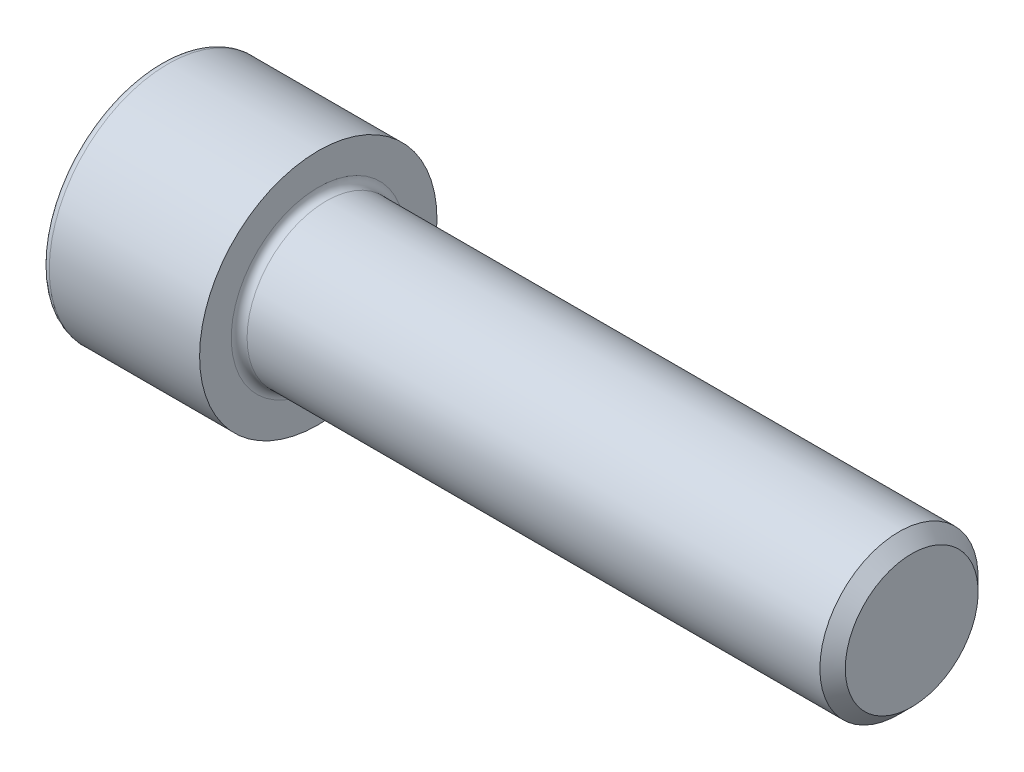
ISO-10303-21;
HEADER;
FILE_DESCRIPTION(('STEP AP214'),'2;1');
FILE_NAME('part.step','',(''),(''),'','','');
FILE_SCHEMA(('AUTOMOTIVE_DESIGN { 1 0 10303 214 1 1 1 1 }'));
ENDSEC;
DATA;
#1=APPLICATION_CONTEXT('core data for automotive mechanical design processes');
#2=APPLICATION_PROTOCOL_DEFINITION('international standard','automotive_design',2000,#1);
#3=PRODUCT_CONTEXT('',#1,'mechanical');
#4=PRODUCT('Part','Part','',(#3));
#5=PRODUCT_RELATED_PRODUCT_CATEGORY('part','',(#4));
#6=PRODUCT_DEFINITION_FORMATION('','',#4);
#7=PRODUCT_DEFINITION_CONTEXT('part definition',#1,'design');
#8=PRODUCT_DEFINITION('design','',#6,#7);
#9=PRODUCT_DEFINITION_SHAPE('','',#8);
#10=(LENGTH_UNIT() NAMED_UNIT(*) SI_UNIT(.MILLI.,.METRE.));
#11=(NAMED_UNIT(*) PLANE_ANGLE_UNIT() SI_UNIT($,.RADIAN.));
#12=(NAMED_UNIT(*) SI_UNIT($,.STERADIAN.) SOLID_ANGLE_UNIT());
#13=UNCERTAINTY_MEASURE_WITH_UNIT(LENGTH_MEASURE(1.E-05),#10,'distance_accuracy_value','');
#14=(GEOMETRIC_REPRESENTATION_CONTEXT(3) GLOBAL_UNCERTAINTY_ASSIGNED_CONTEXT((#13)) GLOBAL_UNIT_ASSIGNED_CONTEXT((#10,
#11,#12)) REPRESENTATION_CONTEXT('',''));
#15=CARTESIAN_POINT('',(0.,0.,0.));
#16=DIRECTION('',(0.,0.,1.));
#17=DIRECTION('',(1.,0.,0.));
#18=AXIS2_PLACEMENT_3D('',#15,#16,#17);
#19=CARTESIAN_POINT('',(0.,0.,0.));
#20=DIRECTION('',(-1.,0.,0.));
#21=DIRECTION('',(0.,0.,1.));
#22=AXIS2_PLACEMENT_3D('',#19,#20,#21);
#23=PLANE('',#22);
#24=DIRECTION('',(0.,-0.499999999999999,0.866025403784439));
#25=VECTOR('',#24,1.);
#26=CARTESIAN_POINT('',(-1.11022302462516E-13,5.83989797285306,0.));
#27=LINE('',#26,#25);
#28=CARTESIAN_POINT('',(-1.11022302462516E-13,5.83989797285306,0.));
#29=VERTEX_POINT('',#28);
#30=CARTESIAN_POINT('',(0.,2.91994898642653,5.05749999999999));
#31=VERTEX_POINT('',#30);
#32=EDGE_CURVE('E266',#29,#31,#27,.T.);
#33=ORIENTED_EDGE('',*,*,#32,.T.);
#34=DIRECTION('',(0.,1.,0.));
#35=VECTOR('',#34,1.);
#36=CARTESIAN_POINT('',(0.,-2.91994898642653,5.05750000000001));
#37=LINE('',#36,#35);
#38=CARTESIAN_POINT('',(0.,-2.91994898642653,5.05750000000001));
#39=VERTEX_POINT('',#38);
#40=EDGE_CURVE('E138',#39,#31,#37,.T.);
#41=ORIENTED_EDGE('',*,*,#40,.F.);
#42=DIRECTION('',(0.,-0.500000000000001,-0.866025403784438));
#43=VECTOR('',#42,1.);
#44=CARTESIAN_POINT('',(0.,-2.91994898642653,5.05750000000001));
#45=LINE('',#44,#43);
#46=CARTESIAN_POINT('',(0.,-5.83989797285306,0.));
#47=VERTEX_POINT('',#46);
#48=EDGE_CURVE('E269',#39,#47,#45,.T.);
#49=ORIENTED_EDGE('',*,*,#48,.T.);
#50=DIRECTION('',(0.,0.499999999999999,-0.866025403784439));
#51=VECTOR('',#50,1.);
#52=CARTESIAN_POINT('',(0.,-5.83989797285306,0.));
#53=LINE('',#52,#51);
#54=CARTESIAN_POINT('',(0.,-2.91994898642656,-5.05749999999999));
#55=VERTEX_POINT('',#54);
#56=EDGE_CURVE('E272',#47,#55,#53,.T.);
#57=ORIENTED_EDGE('',*,*,#56,.T.);
#58=DIRECTION('',(0.,-1.,0.));
#59=VECTOR('',#58,1.);
#60=CARTESIAN_POINT('',(0.,2.91994898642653,-5.0575));
#61=LINE('',#60,#59);
#62=CARTESIAN_POINT('',(0.,2.91994898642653,-5.0575));
#63=VERTEX_POINT('',#62);
#64=EDGE_CURVE('E275',#63,#55,#61,.T.);
#65=ORIENTED_EDGE('',*,*,#64,.F.);
#66=DIRECTION('',(0.,-0.500000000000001,-0.866025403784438));
#67=VECTOR('',#66,1.);
#68=CARTESIAN_POINT('',(-1.11022302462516E-13,5.83989797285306,0.));
#69=LINE('',#68,#67);
#70=EDGE_CURVE('E133',#29,#63,#69,.T.);
#71=ORIENTED_EDGE('',*,*,#70,.F.);
#72=EDGE_LOOP('',(#33,#41,#49,#57,#65,#71));
#73=FACE_BOUND('',#72,.T.);
#74=CARTESIAN_POINT('',(0.,0.,0.));
#75=DIRECTION('',(-1.,0.,0.));
#76=DIRECTION('',(0.,0.,1.));
#77=AXIS2_PLACEMENT_3D('',#74,#75,#76);
#78=CIRCLE('',#77,8.4);
#79=CARTESIAN_POINT('',(0.,0.,8.4));
#80=VERTEX_POINT('',#79);
#81=EDGE_CURVE('E50',#80,#80,#78,.T.);
#82=ORIENTED_EDGE('',*,*,#81,.T.);
#83=EDGE_LOOP('',(#82));
#84=FACE_BOUND('',#83,.T.);
#85=ADVANCED_FACE('F42',(#73,#84),#23,.T.);
#86=CARTESIAN_POINT('',(-31.75,0.,0.));
#87=DIRECTION('',(-1.,0.,0.));
#88=DIRECTION('',(0.,0.,1.));
#89=AXIS2_PLACEMENT_3D('',#86,#87,#88);
#90=CYLINDRICAL_SURFACE('',#89,9.);
#91=CARTESIAN_POINT('',(0.600000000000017,0.,0.));
#92=DIRECTION('',(-1.,0.,0.));
#93=DIRECTION('',(0.,0.,1.));
#94=AXIS2_PLACEMENT_3D('',#91,#92,#93);
#95=CIRCLE('',#94,9.);
#96=CARTESIAN_POINT('',(0.600000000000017,0.,9.));
#97=VERTEX_POINT('',#96);
#98=EDGE_CURVE('E13',#97,#97,#95,.F.);
#99=ORIENTED_EDGE('',*,*,#98,.T.);
#100=EDGE_LOOP('',(#99));
#101=FACE_BOUND('',#100,.T.);
#102=CARTESIAN_POINT('',(12.,0.,0.));
#103=DIRECTION('',(-1.,0.,0.));
#104=DIRECTION('',(0.,0.,1.));
#105=AXIS2_PLACEMENT_3D('',#102,#103,#104);
#106=CIRCLE('',#105,9.);
#107=CARTESIAN_POINT('',(12.,0.,9.));
#108=VERTEX_POINT('',#107);
#109=EDGE_CURVE('E156',#108,#108,#106,.T.);
#110=ORIENTED_EDGE('',*,*,#109,.T.);
#111=EDGE_LOOP('',(#110));
#112=FACE_BOUND('',#111,.T.);
#113=ADVANCED_FACE('F180',(#101,#112),#90,.T.);
#114=CARTESIAN_POINT('',(11.9999999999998,9.,0.));
#115=DIRECTION('',(1.,0.,0.));
#116=DIRECTION('',(0.,0.,-1.));
#117=AXIS2_PLACEMENT_3D('',#114,#115,#116);
#118=PLANE('',#117);
#119=CARTESIAN_POINT('',(12.,0.,0.));
#120=DIRECTION('',(1.,0.,0.));
#121=DIRECTION('',(0.,0.,-1.));
#122=AXIS2_PLACEMENT_3D('',#119,#120,#121);
#123=CIRCLE('',#122,6.59999999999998);
#124=CARTESIAN_POINT('',(12.,0.,-6.59999999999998));
#125=VERTEX_POINT('',#124);
#126=EDGE_CURVE('E159',#125,#125,#123,.F.);
#127=ORIENTED_EDGE('',*,*,#126,.T.);
#128=EDGE_LOOP('',(#127));
#129=FACE_BOUND('',#128,.T.);
#130=ORIENTED_EDGE('',*,*,#109,.F.);
#131=EDGE_LOOP('',(#130));
#132=FACE_BOUND('',#131,.T.);
#133=ADVANCED_FACE('F186',(#129,#132),#118,.T.);
#134=CARTESIAN_POINT('',(-31.75,0.,0.));
#135=DIRECTION('',(-1.,0.,0.));
#136=DIRECTION('',(0.,0.,1.));
#137=AXIS2_PLACEMENT_3D('',#134,#135,#136);
#138=CYLINDRICAL_SURFACE('',#137,5.99999999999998);
#139=CARTESIAN_POINT('',(12.6,0.,0.));
#140=DIRECTION('',(1.,0.,0.));
#141=DIRECTION('',(0.,0.,-1.));
#142=AXIS2_PLACEMENT_3D('',#139,#140,#141);
#143=CIRCLE('',#142,5.99999999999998);
#144=CARTESIAN_POINT('',(12.6,0.,-5.99999999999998));
#145=VERTEX_POINT('',#144);
#146=EDGE_CURVE('E162',#145,#145,#143,.T.);
#147=ORIENTED_EDGE('',*,*,#146,.T.);
#148=EDGE_LOOP('',(#147));
#149=FACE_BOUND('',#148,.T.);
#150=CARTESIAN_POINT('',(56.036,0.,0.));
#151=DIRECTION('',(-1.,0.,0.));
#152=DIRECTION('',(0.,0.,1.));
#153=AXIS2_PLACEMENT_3D('',#150,#151,#152);
#154=CIRCLE('',#153,5.99999999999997);
#155=CARTESIAN_POINT('',(56.036,0.,5.99999999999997));
#156=VERTEX_POINT('',#155);
#157=EDGE_CURVE('E153',#156,#156,#154,.T.);
#158=ORIENTED_EDGE('',*,*,#157,.T.);
#159=EDGE_LOOP('',(#158));
#160=FACE_BOUND('',#159,.T.);
#161=ADVANCED_FACE('F192',(#149,#160),#138,.T.);
#162=CARTESIAN_POINT('',(57.,0.,0.));
#163=DIRECTION('',(-1.,0.,0.));
#164=DIRECTION('',(0.,0.,1.));
#165=AXIS2_PLACEMENT_3D('',#162,#163,#164);
#166=CONICAL_SURFACE('',#165,5.036,0.785398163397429);
#167=ORIENTED_EDGE('',*,*,#157,.F.);
#168=EDGE_LOOP('',(#167));
#169=FACE_BOUND('',#168,.T.);
#170=CARTESIAN_POINT('',(57.,0.,0.));
#171=DIRECTION('',(-1.,0.,0.));
#172=DIRECTION('',(0.,0.,1.));
#173=AXIS2_PLACEMENT_3D('',#170,#171,#172);
#174=CIRCLE('',#173,5.036);
#175=CARTESIAN_POINT('',(57.,0.,5.036));
#176=VERTEX_POINT('',#175);
#177=EDGE_CURVE('E149',#176,#176,#174,.T.);
#178=ORIENTED_EDGE('',*,*,#177,.T.);
#179=EDGE_LOOP('',(#178));
#180=FACE_BOUND('',#179,.T.);
#181=ADVANCED_FACE('F196',(#169,#180),#166,.T.);
#182=CARTESIAN_POINT('',(57.,5.03599999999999,0.));
#183=DIRECTION('',(1.,0.,0.));
#184=DIRECTION('',(0.,0.,-1.));
#185=AXIS2_PLACEMENT_3D('',#182,#183,#184);
#186=PLANE('',#185);
#187=ORIENTED_EDGE('',*,*,#177,.F.);
#188=EDGE_LOOP('',(#187));
#189=FACE_BOUND('',#188,.T.);
#190=ADVANCED_FACE('F176',(#189),#186,.T.);
#191=CARTESIAN_POINT('',(12.6,0.,0.));
#192=DIRECTION('',(1.,0.,0.));
#193=DIRECTION('',(0.,0.,-1.));
#194=AXIS2_PLACEMENT_3D('',#191,#192,#193);
#195=TOROIDAL_SURFACE('',#194,6.59999999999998,0.6);
#196=ORIENTED_EDGE('',*,*,#146,.F.);
#197=EDGE_LOOP('',(#196));
#198=FACE_BOUND('',#197,.T.);
#199=ORIENTED_EDGE('',*,*,#126,.F.);
#200=EDGE_LOOP('',(#199));
#201=FACE_BOUND('',#200,.T.);
#202=ADVANCED_FACE('F169',(#198,#201),#195,.F.);
#203=CARTESIAN_POINT('',(0.600000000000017,0.,0.));
#204=DIRECTION('',(-1.,0.,0.));
#205=DIRECTION('',(0.,0.,1.));
#206=AXIS2_PLACEMENT_3D('',#203,#204,#205);
#207=TOROIDAL_SURFACE('',#206,8.4,0.6);
#208=ORIENTED_EDGE('',*,*,#98,.F.);
#209=EDGE_LOOP('',(#208));
#210=FACE_BOUND('',#209,.T.);
#211=ORIENTED_EDGE('',*,*,#81,.F.);
#212=EDGE_LOOP('',(#211));
#213=FACE_BOUND('',#212,.T.);
#214=ADVANCED_FACE('F44',(#210,#213),#207,.T.);
#215=CARTESIAN_POINT('',(5.99999999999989,5.83989797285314,0.));
#216=DIRECTION('',(0.,-0.866025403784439,-0.499999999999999));
#217=DIRECTION('',(0.,0.499999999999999,-0.866025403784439));
#218=AXIS2_PLACEMENT_3D('',#215,#216,#217);
#219=PLANE('',#218);
#220=ORIENTED_EDGE('',*,*,#32,.F.);
#221=DIRECTION('',(-1.,0.,0.));
#222=VECTOR('',#221,1.);
#223=CARTESIAN_POINT('',(5.99999999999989,5.83989797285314,0.));
#224=LINE('',#223,#222);
#225=CARTESIAN_POINT('',(5.99999999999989,5.83989797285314,0.));
#226=VERTEX_POINT('',#225);
#227=EDGE_CURVE('E256',#226,#29,#224,.T.);
#228=ORIENTED_EDGE('',*,*,#227,.F.);
#229=DIRECTION('',(0.,-0.499999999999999,0.866025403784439));
#230=VECTOR('',#229,1.);
#231=CARTESIAN_POINT('',(5.99999999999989,5.83989797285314,0.));
#232=LINE('',#231,#230);
#233=CARTESIAN_POINT('',(6.00000000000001,4.37992347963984,2.52874999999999));
#234=VERTEX_POINT('',#233);
#235=EDGE_CURVE('E125',#226,#234,#232,.T.);
#236=ORIENTED_EDGE('',*,*,#235,.T.);
#237=CARTESIAN_POINT('',(6.00000000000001,2.91994898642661,5.05749999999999));
#238=VERTEX_POINT('',#237);
#239=EDGE_CURVE('E116',#234,#238,#232,.T.);
#240=ORIENTED_EDGE('',*,*,#239,.T.);
#241=DIRECTION('',(-1.,0.,0.));
#242=VECTOR('',#241,1.);
#243=CARTESIAN_POINT('',(6.00000000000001,2.91994898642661,5.05749999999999));
#244=LINE('',#243,#242);
#245=EDGE_CURVE('E130',#238,#31,#244,.T.);
#246=ORIENTED_EDGE('',*,*,#245,.T.);
#247=EDGE_LOOP('',(#220,#228,#236,#240,#246));
#248=FACE_BOUND('',#247,.T.);
#249=ADVANCED_FACE('F129',(#248),#219,.T.);
#250=CARTESIAN_POINT('',(6.00000000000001,-2.91994898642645,5.0575));
#251=DIRECTION('',(0.,0.,1.));
#252=DIRECTION('',(0.,-1.,0.));
#253=AXIS2_PLACEMENT_3D('',#250,#251,#252);
#254=PLANE('',#253);
#255=ORIENTED_EDGE('',*,*,#40,.T.);
#256=ORIENTED_EDGE('',*,*,#245,.F.);
#257=DIRECTION('',(0.,1.,0.));
#258=VECTOR('',#257,1.);
#259=CARTESIAN_POINT('',(6.00000000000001,-2.91994898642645,5.0575));
#260=LINE('',#259,#258);
#261=CARTESIAN_POINT('',(6.00000000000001,0.,5.0575));
#262=VERTEX_POINT('',#261);
#263=EDGE_CURVE('E113',#262,#238,#260,.T.);
#264=ORIENTED_EDGE('',*,*,#263,.F.);
#265=CARTESIAN_POINT('',(6.00000000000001,-2.91994898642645,5.0575));
#266=VERTEX_POINT('',#265);
#267=EDGE_CURVE('E124',#266,#262,#260,.T.);
#268=ORIENTED_EDGE('',*,*,#267,.F.);
#269=DIRECTION('',(-1.,0.,0.));
#270=VECTOR('',#269,1.);
#271=CARTESIAN_POINT('',(6.00000000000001,-2.91994898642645,5.0575));
#272=LINE('',#271,#270);
#273=EDGE_CURVE('E140',#266,#39,#272,.T.);
#274=ORIENTED_EDGE('',*,*,#273,.T.);
#275=EDGE_LOOP('',(#255,#256,#264,#268,#274));
#276=FACE_BOUND('',#275,.T.);
#277=ADVANCED_FACE('F135',(#276),#254,.F.);
#278=CARTESIAN_POINT('',(6.00000000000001,-2.91994898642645,5.0575));
#279=DIRECTION('',(0.,0.866025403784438,-0.500000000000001));
#280=DIRECTION('',(0.,0.500000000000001,0.866025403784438));
#281=AXIS2_PLACEMENT_3D('',#278,#279,#280);
#282=PLANE('',#281);
#283=ORIENTED_EDGE('',*,*,#48,.F.);
#284=ORIENTED_EDGE('',*,*,#273,.F.);
#285=DIRECTION('',(0.,-0.500000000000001,-0.866025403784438));
#286=VECTOR('',#285,1.);
#287=CARTESIAN_POINT('',(6.00000000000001,-2.91994898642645,5.0575));
#288=LINE('',#287,#286);
#289=CARTESIAN_POINT('',(6.00000000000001,-4.37992347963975,2.52875));
#290=VERTEX_POINT('',#289);
#291=EDGE_CURVE('E295',#266,#290,#288,.T.);
#292=ORIENTED_EDGE('',*,*,#291,.T.);
#293=CARTESIAN_POINT('',(6.00000000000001,-5.839897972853,0.));
#294=VERTEX_POINT('',#293);
#295=EDGE_CURVE('E284',#290,#294,#288,.T.);
#296=ORIENTED_EDGE('',*,*,#295,.T.);
#297=DIRECTION('',(-1.,0.,0.));
#298=VECTOR('',#297,1.);
#299=CARTESIAN_POINT('',(6.00000000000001,-5.839897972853,0.));
#300=LINE('',#299,#298);
#301=EDGE_CURVE('E145',#294,#47,#300,.T.);
#302=ORIENTED_EDGE('',*,*,#301,.T.);
#303=EDGE_LOOP('',(#283,#284,#292,#296,#302));
#304=FACE_BOUND('',#303,.T.);
#305=ADVANCED_FACE('F210',(#304),#282,.T.);
#306=CARTESIAN_POINT('',(6.00000000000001,-5.839897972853,0.));
#307=DIRECTION('',(0.,0.866025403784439,0.499999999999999));
#308=DIRECTION('',(0.,-0.499999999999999,0.866025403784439));
#309=AXIS2_PLACEMENT_3D('',#306,#307,#308);
#310=PLANE('',#309);
#311=ORIENTED_EDGE('',*,*,#56,.F.);
#312=ORIENTED_EDGE('',*,*,#301,.F.);
#313=DIRECTION('',(0.,0.499999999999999,-0.866025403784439));
#314=VECTOR('',#313,1.);
#315=CARTESIAN_POINT('',(6.00000000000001,-5.839897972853,0.));
#316=LINE('',#315,#314);
#317=CARTESIAN_POINT('',(6.00000000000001,-4.37992347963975,-2.52875));
#318=VERTEX_POINT('',#317);
#319=EDGE_CURVE('E262',#294,#318,#316,.T.);
#320=ORIENTED_EDGE('',*,*,#319,.T.);
#321=CARTESIAN_POINT('',(6.00000000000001,-2.91994898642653,-5.0575));
#322=VERTEX_POINT('',#321);
#323=EDGE_CURVE('E294',#318,#322,#316,.T.);
#324=ORIENTED_EDGE('',*,*,#323,.T.);
#325=DIRECTION('',(-1.,0.,0.));
#326=VECTOR('',#325,1.);
#327=CARTESIAN_POINT('',(6.00000000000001,-2.91994898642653,-5.0575));
#328=LINE('',#327,#326);
#329=EDGE_CURVE('E255',#322,#55,#328,.T.);
#330=ORIENTED_EDGE('',*,*,#329,.T.);
#331=EDGE_LOOP('',(#311,#312,#320,#324,#330));
#332=FACE_BOUND('',#331,.T.);
#333=ADVANCED_FACE('F213',(#332),#310,.T.);
#334=CARTESIAN_POINT('',(6.00000000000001,2.91994898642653,-5.0575));
#335=DIRECTION('',(0.,0.,-1.));
#336=DIRECTION('',(0.,1.,0.));
#337=AXIS2_PLACEMENT_3D('',#334,#335,#336);
#338=PLANE('',#337);
#339=ORIENTED_EDGE('',*,*,#64,.T.);
#340=ORIENTED_EDGE('',*,*,#329,.F.);
#341=DIRECTION('',(0.,-1.,0.));
#342=VECTOR('',#341,1.);
#343=CARTESIAN_POINT('',(6.00000000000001,2.91994898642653,-5.0575));
#344=LINE('',#343,#342);
#345=CARTESIAN_POINT('',(6.00000000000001,0.,-5.05749999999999));
#346=VERTEX_POINT('',#345);
#347=EDGE_CURVE('E259',#346,#322,#344,.T.);
#348=ORIENTED_EDGE('',*,*,#347,.F.);
#349=CARTESIAN_POINT('',(6.00000000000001,2.91994898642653,-5.0575));
#350=VERTEX_POINT('',#349);
#351=EDGE_CURVE('E57',#350,#346,#344,.T.);
#352=ORIENTED_EDGE('',*,*,#351,.F.);
#353=DIRECTION('',(-1.,0.,0.));
#354=VECTOR('',#353,1.);
#355=CARTESIAN_POINT('',(6.00000000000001,2.91994898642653,-5.0575));
#356=LINE('',#355,#354);
#357=EDGE_CURVE('E252',#350,#63,#356,.T.);
#358=ORIENTED_EDGE('',*,*,#357,.T.);
#359=EDGE_LOOP('',(#339,#340,#348,#352,#358));
#360=FACE_BOUND('',#359,.T.);
#361=ADVANCED_FACE('F217',(#360),#338,.F.);
#362=CARTESIAN_POINT('',(5.99999999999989,5.83989797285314,0.));
#363=DIRECTION('',(0.,0.866025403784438,-0.500000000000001));
#364=DIRECTION('',(0.,0.500000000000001,0.866025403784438));
#365=AXIS2_PLACEMENT_3D('',#362,#363,#364);
#366=PLANE('',#365);
#367=ORIENTED_EDGE('',*,*,#70,.T.);
#368=ORIENTED_EDGE('',*,*,#357,.F.);
#369=DIRECTION('',(0.,-0.500000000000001,-0.866025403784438));
#370=VECTOR('',#369,1.);
#371=CARTESIAN_POINT('',(5.99999999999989,5.83989797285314,0.));
#372=LINE('',#371,#370);
#373=CARTESIAN_POINT('',(6.00000000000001,4.37992347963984,-2.52875));
#374=VERTEX_POINT('',#373);
#375=EDGE_CURVE('E242',#374,#350,#372,.T.);
#376=ORIENTED_EDGE('',*,*,#375,.F.);
#377=EDGE_CURVE('E248',#226,#374,#372,.T.);
#378=ORIENTED_EDGE('',*,*,#377,.F.);
#379=ORIENTED_EDGE('',*,*,#227,.T.);
#380=EDGE_LOOP('',(#367,#368,#376,#378,#379));
#381=FACE_BOUND('',#380,.T.);
#382=ADVANCED_FACE('F221',(#381),#366,.F.);
#383=CARTESIAN_POINT('',(5.99999999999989,5.83989797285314,0.));
#384=DIRECTION('',(1.,0.,0.));
#385=DIRECTION('',(0.,0.,-1.));
#386=AXIS2_PLACEMENT_3D('',#383,#384,#385);
#387=PLANE('',#386);
#388=ORIENTED_EDGE('',*,*,#347,.T.);
#389=ORIENTED_EDGE('',*,*,#323,.F.);
#390=CARTESIAN_POINT('',(6.00000000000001,0.,0.));
#391=DIRECTION('',(-1.,0.,0.));
#392=DIRECTION('',(0.,0.,1.));
#393=AXIS2_PLACEMENT_3D('',#390,#391,#392);
#394=CIRCLE('',#393,5.0575);
#395=EDGE_CURVE('E290',#346,#318,#394,.T.);
#396=ORIENTED_EDGE('',*,*,#395,.F.);
#397=EDGE_LOOP('',(#388,#389,#396));
#398=FACE_BOUND('',#397,.T.);
#399=ADVANCED_FACE('F225',(#398),#387,.F.);
#400=ORIENTED_EDGE('',*,*,#319,.F.);
#401=ORIENTED_EDGE('',*,*,#295,.F.);
#402=EDGE_CURVE('E143',#318,#290,#394,.T.);
#403=ORIENTED_EDGE('',*,*,#402,.F.);
#404=EDGE_LOOP('',(#400,#401,#403));
#405=FACE_BOUND('',#404,.T.);
#406=ADVANCED_FACE('F228',(#405),#387,.F.);
#407=ORIENTED_EDGE('',*,*,#291,.F.);
#408=ORIENTED_EDGE('',*,*,#267,.T.);
#409=EDGE_CURVE('E139',#290,#262,#394,.T.);
#410=ORIENTED_EDGE('',*,*,#409,.F.);
#411=EDGE_LOOP('',(#407,#408,#410));
#412=FACE_BOUND('',#411,.T.);
#413=ADVANCED_FACE('F233',(#412),#387,.F.);
#414=ORIENTED_EDGE('',*,*,#263,.T.);
#415=ORIENTED_EDGE('',*,*,#239,.F.);
#416=EDGE_CURVE('E119',#262,#234,#394,.T.);
#417=ORIENTED_EDGE('',*,*,#416,.F.);
#418=EDGE_LOOP('',(#414,#415,#417));
#419=FACE_BOUND('',#418,.T.);
#420=ADVANCED_FACE('F115',(#419),#387,.F.);
#421=ORIENTED_EDGE('',*,*,#235,.F.);
#422=ORIENTED_EDGE('',*,*,#377,.T.);
#423=EDGE_CURVE('E150',#234,#374,#394,.T.);
#424=ORIENTED_EDGE('',*,*,#423,.F.);
#425=EDGE_LOOP('',(#421,#422,#424));
#426=FACE_BOUND('',#425,.T.);
#427=ADVANCED_FACE('F236',(#426),#387,.F.);
#428=ORIENTED_EDGE('',*,*,#375,.T.);
#429=ORIENTED_EDGE('',*,*,#351,.T.);
#430=EDGE_CURVE('E245',#374,#346,#394,.T.);
#431=ORIENTED_EDGE('',*,*,#430,.F.);
#432=EDGE_LOOP('',(#428,#429,#431));
#433=FACE_BOUND('',#432,.T.);
#434=ADVANCED_FACE('F206',(#433),#387,.F.);
#435=CARTESIAN_POINT('',(6.00000000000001,0.,0.));
#436=DIRECTION('',(-1.,0.,0.));
#437=DIRECTION('',(0.,0.,1.));
#438=AXIS2_PLACEMENT_3D('',#435,#436,#437);
#439=CONICAL_SURFACE('',#438,5.0575,1.04719755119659);
#440=CARTESIAN_POINT('',(8.91994898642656,0.,0.));
#441=VERTEX_POINT('',#440);
#442=VERTEX_LOOP('',#441);
#443=FACE_BOUND('',#442,.T.);
#444=ORIENTED_EDGE('',*,*,#416,.T.);
#445=ORIENTED_EDGE('',*,*,#423,.T.);
#446=ORIENTED_EDGE('',*,*,#430,.T.);
#447=ORIENTED_EDGE('',*,*,#395,.T.);
#448=ORIENTED_EDGE('',*,*,#402,.T.);
#449=ORIENTED_EDGE('',*,*,#409,.T.);
#450=EDGE_LOOP('',(#444,#445,#446,#447,#448,#449));
#451=FACE_BOUND('',#450,.T.);
#452=ADVANCED_FACE('F204',(#443,#451),#439,.F.);
#453=CLOSED_SHELL('',(#85,#113,#133,#161,#181,#190,#202,#214,#249,#277,#305,#333,#361,#382,#399,
#406,#413,#420,#427,#434,#452));
#454=MANIFOLD_SOLID_BREP('B2',#453);
#455=ADVANCED_BREP_SHAPE_REPRESENTATION('',(#18,#454),#14);
#456=SHAPE_DEFINITION_REPRESENTATION(#9,#455);
ENDSEC;
END-ISO-10303-21;
